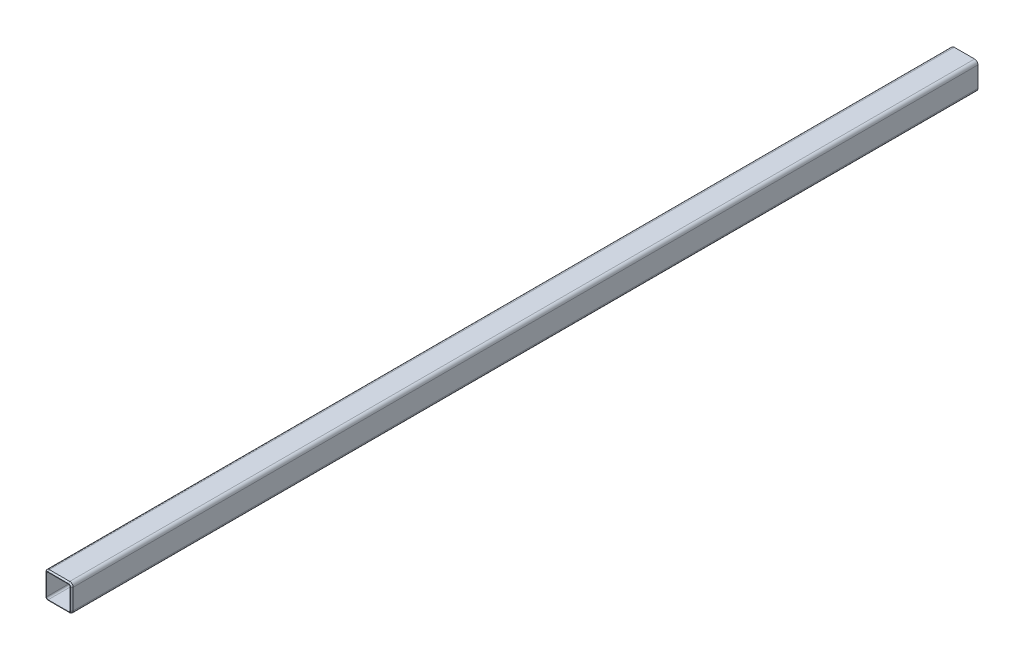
ISO-10303-21;
HEADER;
FILE_DESCRIPTION(('STEP AP214'),'2;1');
FILE_NAME('part.step','',(''),(''),'','','');
FILE_SCHEMA(('AUTOMOTIVE_DESIGN { 1 0 10303 214 1 1 1 1 }'));
ENDSEC;
DATA;
#1=APPLICATION_CONTEXT('core data for automotive mechanical design processes');
#2=APPLICATION_PROTOCOL_DEFINITION('international standard','automotive_design',2000,#1);
#3=PRODUCT_CONTEXT('',#1,'mechanical');
#4=PRODUCT('Part','Part','',(#3));
#5=PRODUCT_RELATED_PRODUCT_CATEGORY('part','',(#4));
#6=PRODUCT_DEFINITION_FORMATION('','',#4);
#7=PRODUCT_DEFINITION_CONTEXT('part definition',#1,'design');
#8=PRODUCT_DEFINITION('design','',#6,#7);
#9=PRODUCT_DEFINITION_SHAPE('','',#8);
#10=(LENGTH_UNIT() NAMED_UNIT(*) SI_UNIT(.MILLI.,.METRE.));
#11=(NAMED_UNIT(*) PLANE_ANGLE_UNIT() SI_UNIT($,.RADIAN.));
#12=(NAMED_UNIT(*) SI_UNIT($,.STERADIAN.) SOLID_ANGLE_UNIT());
#13=UNCERTAINTY_MEASURE_WITH_UNIT(LENGTH_MEASURE(1.E-05),#10,'distance_accuracy_value','');
#14=(GEOMETRIC_REPRESENTATION_CONTEXT(3) GLOBAL_UNCERTAINTY_ASSIGNED_CONTEXT((#13)) GLOBAL_UNIT_ASSIGNED_CONTEXT((#10,
#11,#12)) REPRESENTATION_CONTEXT('',''));
#15=CARTESIAN_POINT('',(0.,0.,0.));
#16=DIRECTION('',(0.,0.,1.));
#17=DIRECTION('',(1.,0.,0.));
#18=AXIS2_PLACEMENT_3D('',#15,#16,#17);
#19=CARTESIAN_POINT('',(-76.2,76.2,-101.6));
#20=DIRECTION('',(0.,0.,1.));
#21=DIRECTION('',(1.,0.,0.));
#22=AXIS2_PLACEMENT_3D('',#19,#20,#21);
#23=CYLINDRICAL_SURFACE('',#22,25.4);
#24=DIRECTION('',(0.,0.,1.));
#25=VECTOR('',#24,1.);
#26=CARTESIAN_POINT('',(-101.6,76.2,-101.6));
#27=LINE('',#26,#25);
#28=CARTESIAN_POINT('',(-101.6,76.2,-101.6));
#29=VERTEX_POINT('',#28);
#30=CARTESIAN_POINT('',(-101.6,76.2,6671.405));
#31=VERTEX_POINT('',#30);
#32=EDGE_CURVE('E318',#29,#31,#27,.T.);
#33=ORIENTED_EDGE('',*,*,#32,.T.);
#34=CARTESIAN_POINT('',(-76.2,76.2,6671.405));
#35=DIRECTION('',(0.,0.,1.));
#36=DIRECTION('',(1.,0.,0.));
#37=AXIS2_PLACEMENT_3D('',#34,#35,#36);
#38=CIRCLE('',#37,25.4);
#39=CARTESIAN_POINT('',(-76.2,101.6,6671.405));
#40=VERTEX_POINT('',#39);
#41=EDGE_CURVE('E379',#31,#40,#38,.F.);
#42=ORIENTED_EDGE('',*,*,#41,.T.);
#43=DIRECTION('',(0.,0.,1.));
#44=VECTOR('',#43,1.);
#45=CARTESIAN_POINT('',(-76.2,101.6,-101.6));
#46=LINE('',#45,#44);
#47=CARTESIAN_POINT('',(-76.2,101.6,-101.6));
#48=VERTEX_POINT('',#47);
#49=EDGE_CURVE('E319',#48,#40,#46,.T.);
#50=ORIENTED_EDGE('',*,*,#49,.F.);
#51=CARTESIAN_POINT('',(-76.2,76.2,-101.6));
#52=DIRECTION('',(0.,0.,1.));
#53=DIRECTION('',(1.,0.,0.));
#54=AXIS2_PLACEMENT_3D('',#51,#52,#53);
#55=CIRCLE('',#54,25.4);
#56=EDGE_CURVE('E269',#48,#29,#55,.T.);
#57=ORIENTED_EDGE('',*,*,#56,.T.);
#58=EDGE_LOOP('',(#33,#42,#50,#57));
#59=FACE_BOUND('',#58,.T.);
#60=ADVANCED_FACE('F47',(#59),#23,.T.);
#61=CARTESIAN_POINT('',(-76.2,101.6,-101.6));
#62=DIRECTION('',(0.,1.,0.));
#63=DIRECTION('',(0.,0.,1.));
#64=AXIS2_PLACEMENT_3D('',#61,#62,#63);
#65=PLANE('',#64);
#66=ORIENTED_EDGE('',*,*,#49,.T.);
#67=DIRECTION('',(1.,0.,0.));
#68=VECTOR('',#67,1.);
#69=CARTESIAN_POINT('',(-76.2,101.6,6671.405));
#70=LINE('',#69,#68);
#71=CARTESIAN_POINT('',(76.2,101.6,6671.405));
#72=VERTEX_POINT('',#71);
#73=EDGE_CURVE('E376',#40,#72,#70,.T.);
#74=ORIENTED_EDGE('',*,*,#73,.T.);
#75=DIRECTION('',(0.,0.,1.));
#76=VECTOR('',#75,1.);
#77=CARTESIAN_POINT('',(76.2,101.6,-101.6));
#78=LINE('',#77,#76);
#79=CARTESIAN_POINT('',(76.2,101.6,-101.6));
#80=VERTEX_POINT('',#79);
#81=EDGE_CURVE('E324',#80,#72,#78,.T.);
#82=ORIENTED_EDGE('',*,*,#81,.F.);
#83=DIRECTION('',(-1.,0.,0.));
#84=VECTOR('',#83,1.);
#85=CARTESIAN_POINT('',(-76.2,101.6,-101.6));
#86=LINE('',#85,#84);
#87=EDGE_CURVE('E314',#80,#48,#86,.T.);
#88=ORIENTED_EDGE('',*,*,#87,.T.);
#89=EDGE_LOOP('',(#66,#74,#82,#88));
#90=FACE_BOUND('',#89,.T.);
#91=ADVANCED_FACE('F448',(#90),#65,.T.);
#92=CARTESIAN_POINT('',(76.2,76.2,-101.6));
#93=DIRECTION('',(0.,0.,1.));
#94=DIRECTION('',(1.,0.,0.));
#95=AXIS2_PLACEMENT_3D('',#92,#93,#94);
#96=CYLINDRICAL_SURFACE('',#95,25.4);
#97=ORIENTED_EDGE('',*,*,#81,.T.);
#98=CARTESIAN_POINT('',(76.2,76.2,6671.405));
#99=DIRECTION('',(0.,0.,1.));
#100=DIRECTION('',(1.,0.,0.));
#101=AXIS2_PLACEMENT_3D('',#98,#99,#100);
#102=CIRCLE('',#101,25.4);
#103=CARTESIAN_POINT('',(101.6,76.2,6671.405));
#104=VERTEX_POINT('',#103);
#105=EDGE_CURVE('E372',#72,#104,#102,.F.);
#106=ORIENTED_EDGE('',*,*,#105,.T.);
#107=DIRECTION('',(0.,0.,1.));
#108=VECTOR('',#107,1.);
#109=CARTESIAN_POINT('',(101.6,76.2,-101.6));
#110=LINE('',#109,#108);
#111=CARTESIAN_POINT('',(101.6,76.2,-101.6));
#112=VERTEX_POINT('',#111);
#113=EDGE_CURVE('E328',#112,#104,#110,.T.);
#114=ORIENTED_EDGE('',*,*,#113,.F.);
#115=CARTESIAN_POINT('',(76.2,76.2,-101.6));
#116=DIRECTION('',(0.,0.,1.));
#117=DIRECTION('',(1.,0.,0.));
#118=AXIS2_PLACEMENT_3D('',#115,#116,#117);
#119=CIRCLE('',#118,25.4);
#120=EDGE_CURVE('E310',#112,#80,#119,.T.);
#121=ORIENTED_EDGE('',*,*,#120,.T.);
#122=EDGE_LOOP('',(#97,#106,#114,#121));
#123=FACE_BOUND('',#122,.T.);
#124=ADVANCED_FACE('F463',(#123),#96,.T.);
#125=CARTESIAN_POINT('',(101.6,-76.2,-101.6));
#126=DIRECTION('',(1.,0.,0.));
#127=DIRECTION('',(0.,0.,-1.));
#128=AXIS2_PLACEMENT_3D('',#125,#126,#127);
#129=PLANE('',#128);
#130=ORIENTED_EDGE('',*,*,#113,.T.);
#131=DIRECTION('',(0.,-1.,0.));
#132=VECTOR('',#131,1.);
#133=CARTESIAN_POINT('',(101.6,-76.2,6671.405));
#134=LINE('',#133,#132);
#135=CARTESIAN_POINT('',(101.6,-76.2,6671.405));
#136=VERTEX_POINT('',#135);
#137=EDGE_CURVE('E11',#104,#136,#134,.T.);
#138=ORIENTED_EDGE('',*,*,#137,.T.);
#139=DIRECTION('',(0.,0.,1.));
#140=VECTOR('',#139,1.);
#141=CARTESIAN_POINT('',(101.6,-76.2,-101.6));
#142=LINE('',#141,#140);
#143=CARTESIAN_POINT('',(101.6,-76.2,-101.6));
#144=VERTEX_POINT('',#143);
#145=EDGE_CURVE('E331',#144,#136,#142,.T.);
#146=ORIENTED_EDGE('',*,*,#145,.F.);
#147=DIRECTION('',(0.,1.,0.));
#148=VECTOR('',#147,1.);
#149=CARTESIAN_POINT('',(101.6,-76.2,-101.6));
#150=LINE('',#149,#148);
#151=EDGE_CURVE('E306',#144,#112,#150,.T.);
#152=ORIENTED_EDGE('',*,*,#151,.T.);
#153=EDGE_LOOP('',(#130,#138,#146,#152));
#154=FACE_BOUND('',#153,.T.);
#155=ADVANCED_FACE('F465',(#154),#129,.T.);
#156=CARTESIAN_POINT('',(76.2,-76.2,-101.6));
#157=DIRECTION('',(0.,0.,1.));
#158=DIRECTION('',(1.,0.,0.));
#159=AXIS2_PLACEMENT_3D('',#156,#157,#158);
#160=CYLINDRICAL_SURFACE('',#159,25.4);
#161=ORIENTED_EDGE('',*,*,#145,.T.);
#162=CARTESIAN_POINT('',(76.2,-76.2,6671.405));
#163=DIRECTION('',(0.,0.,1.));
#164=DIRECTION('',(1.,0.,0.));
#165=AXIS2_PLACEMENT_3D('',#162,#163,#164);
#166=CIRCLE('',#165,25.4);
#167=CARTESIAN_POINT('',(76.2,-101.6,6671.405));
#168=VERTEX_POINT('',#167);
#169=EDGE_CURVE('E58',#136,#168,#166,.F.);
#170=ORIENTED_EDGE('',*,*,#169,.T.);
#171=DIRECTION('',(0.,0.,1.));
#172=VECTOR('',#171,1.);
#173=CARTESIAN_POINT('',(76.2,-101.6,-101.6));
#174=LINE('',#173,#172);
#175=CARTESIAN_POINT('',(76.2,-101.6,-101.6));
#176=VERTEX_POINT('',#175);
#177=EDGE_CURVE('E334',#176,#168,#174,.T.);
#178=ORIENTED_EDGE('',*,*,#177,.F.);
#179=CARTESIAN_POINT('',(76.2,-76.2,-101.6));
#180=DIRECTION('',(0.,0.,1.));
#181=DIRECTION('',(1.,0.,0.));
#182=AXIS2_PLACEMENT_3D('',#179,#180,#181);
#183=CIRCLE('',#182,25.4);
#184=EDGE_CURVE('E302',#176,#144,#183,.T.);
#185=ORIENTED_EDGE('',*,*,#184,.T.);
#186=EDGE_LOOP('',(#161,#170,#178,#185));
#187=FACE_BOUND('',#186,.T.);
#188=ADVANCED_FACE('F468',(#187),#160,.T.);
#189=CARTESIAN_POINT('',(76.2,-101.6,-101.6));
#190=DIRECTION('',(0.,-1.,0.));
#191=DIRECTION('',(0.,0.,-1.));
#192=AXIS2_PLACEMENT_3D('',#189,#190,#191);
#193=PLANE('',#192);
#194=ORIENTED_EDGE('',*,*,#177,.T.);
#195=DIRECTION('',(-1.,0.,0.));
#196=VECTOR('',#195,1.);
#197=CARTESIAN_POINT('',(76.2,-101.6,6671.405));
#198=LINE('',#197,#196);
#199=CARTESIAN_POINT('',(-76.2,-101.6,6671.405));
#200=VERTEX_POINT('',#199);
#201=EDGE_CURVE('E388',#168,#200,#198,.T.);
#202=ORIENTED_EDGE('',*,*,#201,.T.);
#203=DIRECTION('',(0.,0.,1.));
#204=VECTOR('',#203,1.);
#205=CARTESIAN_POINT('',(-76.2,-101.6,-101.6));
#206=LINE('',#205,#204);
#207=CARTESIAN_POINT('',(-76.2,-101.6,-101.6));
#208=VERTEX_POINT('',#207);
#209=EDGE_CURVE('E337',#208,#200,#206,.T.);
#210=ORIENTED_EDGE('',*,*,#209,.F.);
#211=DIRECTION('',(1.,0.,0.));
#212=VECTOR('',#211,1.);
#213=CARTESIAN_POINT('',(76.2,-101.6,-101.6));
#214=LINE('',#213,#212);
#215=EDGE_CURVE('E298',#208,#176,#214,.T.);
#216=ORIENTED_EDGE('',*,*,#215,.T.);
#217=EDGE_LOOP('',(#194,#202,#210,#216));
#218=FACE_BOUND('',#217,.T.);
#219=ADVANCED_FACE('F470',(#218),#193,.T.);
#220=CARTESIAN_POINT('',(-76.2,-76.2,-101.6));
#221=DIRECTION('',(0.,0.,1.));
#222=DIRECTION('',(1.,0.,0.));
#223=AXIS2_PLACEMENT_3D('',#220,#221,#222);
#224=CYLINDRICAL_SURFACE('',#223,25.4);
#225=ORIENTED_EDGE('',*,*,#209,.T.);
#226=CARTESIAN_POINT('',(-76.2,-76.2,6671.405));
#227=DIRECTION('',(0.,0.,1.));
#228=DIRECTION('',(1.,0.,0.));
#229=AXIS2_PLACEMENT_3D('',#226,#227,#228);
#230=CIRCLE('',#229,25.4);
#231=CARTESIAN_POINT('',(-101.6,-76.2,6671.405));
#232=VERTEX_POINT('',#231);
#233=EDGE_CURVE('E385',#200,#232,#230,.F.);
#234=ORIENTED_EDGE('',*,*,#233,.T.);
#235=DIRECTION('',(0.,0.,1.));
#236=VECTOR('',#235,1.);
#237=CARTESIAN_POINT('',(-101.6,-76.2,-101.6));
#238=LINE('',#237,#236);
#239=CARTESIAN_POINT('',(-101.6,-76.2,-101.6));
#240=VERTEX_POINT('',#239);
#241=EDGE_CURVE('E341',#240,#232,#238,.T.);
#242=ORIENTED_EDGE('',*,*,#241,.F.);
#243=CARTESIAN_POINT('',(-76.2,-76.2,-101.6));
#244=DIRECTION('',(0.,0.,1.));
#245=DIRECTION('',(1.,0.,0.));
#246=AXIS2_PLACEMENT_3D('',#243,#244,#245);
#247=CIRCLE('',#246,25.4);
#248=EDGE_CURVE('E294',#240,#208,#247,.T.);
#249=ORIENTED_EDGE('',*,*,#248,.T.);
#250=EDGE_LOOP('',(#225,#234,#242,#249));
#251=FACE_BOUND('',#250,.T.);
#252=ADVANCED_FACE('F433',(#251),#224,.T.);
#253=CARTESIAN_POINT('',(-101.6,76.2,-101.6));
#254=DIRECTION('',(-1.,0.,0.));
#255=DIRECTION('',(0.,-1.,0.));
#256=AXIS2_PLACEMENT_3D('',#253,#254,#255);
#257=PLANE('',#256);
#258=ORIENTED_EDGE('',*,*,#241,.T.);
#259=DIRECTION('',(0.,1.,0.));
#260=VECTOR('',#259,1.);
#261=CARTESIAN_POINT('',(-101.6,76.2,6671.405));
#262=LINE('',#261,#260);
#263=EDGE_CURVE('E382',#232,#31,#262,.T.);
#264=ORIENTED_EDGE('',*,*,#263,.T.);
#265=ORIENTED_EDGE('',*,*,#32,.F.);
#266=DIRECTION('',(0.,-1.,0.));
#267=VECTOR('',#266,1.);
#268=CARTESIAN_POINT('',(-101.6,76.2,-101.6));
#269=LINE('',#268,#267);
#270=EDGE_CURVE('E290',#29,#240,#269,.T.);
#271=ORIENTED_EDGE('',*,*,#270,.T.);
#272=EDGE_LOOP('',(#258,#264,#265,#271));
#273=FACE_BOUND('',#272,.T.);
#274=ADVANCED_FACE('F436',(#273),#257,.T.);
#275=CARTESIAN_POINT('',(-76.2,76.2,-101.6));
#276=DIRECTION('',(0.,0.,1.));
#277=DIRECTION('',(1.,0.,0.));
#278=AXIS2_PLACEMENT_3D('',#275,#276,#277);
#279=PLANE('',#278);
#280=DIRECTION('',(0.,-1.,0.));
#281=VECTOR('',#280,1.);
#282=CARTESIAN_POINT('',(-88.9000000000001,76.2,-101.6));
#283=LINE('',#282,#281);
#284=CARTESIAN_POINT('',(-88.9000000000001,76.2,-101.6));
#285=VERTEX_POINT('',#284);
#286=CARTESIAN_POINT('',(-88.9,-76.2,-101.6));
#287=VERTEX_POINT('',#286);
#288=EDGE_CURVE('E200',#285,#287,#283,.T.);
#289=ORIENTED_EDGE('',*,*,#288,.T.);
#290=CARTESIAN_POINT('',(-76.2,-76.2,-101.6));
#291=DIRECTION('',(0.,0.,1.));
#292=DIRECTION('',(1.,0.,0.));
#293=AXIS2_PLACEMENT_3D('',#290,#291,#292);
#294=CIRCLE('',#293,12.7);
#295=CARTESIAN_POINT('',(-76.2,-88.9,-101.6));
#296=VERTEX_POINT('',#295);
#297=EDGE_CURVE('E239',#287,#296,#294,.T.);
#298=ORIENTED_EDGE('',*,*,#297,.T.);
#299=DIRECTION('',(1.,0.,0.));
#300=VECTOR('',#299,1.);
#301=CARTESIAN_POINT('',(76.2,-88.9,-101.6));
#302=LINE('',#301,#300);
#303=CARTESIAN_POINT('',(76.2,-88.9,-101.6));
#304=VERTEX_POINT('',#303);
#305=EDGE_CURVE('E194',#296,#304,#302,.T.);
#306=ORIENTED_EDGE('',*,*,#305,.T.);
#307=CARTESIAN_POINT('',(76.2,-76.2,-101.6));
#308=DIRECTION('',(0.,0.,1.));
#309=DIRECTION('',(1.,0.,0.));
#310=AXIS2_PLACEMENT_3D('',#307,#308,#309);
#311=CIRCLE('',#310,12.7);
#312=CARTESIAN_POINT('',(88.9,-76.2,-101.6));
#313=VERTEX_POINT('',#312);
#314=EDGE_CURVE('E244',#304,#313,#311,.T.);
#315=ORIENTED_EDGE('',*,*,#314,.T.);
#316=DIRECTION('',(0.,1.,0.));
#317=VECTOR('',#316,1.);
#318=CARTESIAN_POINT('',(88.9,-76.2,-101.6));
#319=LINE('',#318,#317);
#320=CARTESIAN_POINT('',(88.9,76.2,-101.6));
#321=VERTEX_POINT('',#320);
#322=EDGE_CURVE('E248',#313,#321,#319,.T.);
#323=ORIENTED_EDGE('',*,*,#322,.T.);
#324=CARTESIAN_POINT('',(76.2,76.2,-101.6));
#325=DIRECTION('',(0.,0.,1.));
#326=DIRECTION('',(1.,0.,0.));
#327=AXIS2_PLACEMENT_3D('',#324,#325,#326);
#328=CIRCLE('',#327,12.7);
#329=CARTESIAN_POINT('',(76.2,88.9,-101.6));
#330=VERTEX_POINT('',#329);
#331=EDGE_CURVE('E252',#321,#330,#328,.T.);
#332=ORIENTED_EDGE('',*,*,#331,.T.);
#333=DIRECTION('',(-1.,0.,0.));
#334=VECTOR('',#333,1.);
#335=CARTESIAN_POINT('',(-76.2,88.9,-101.6));
#336=LINE('',#335,#334);
#337=CARTESIAN_POINT('',(-76.2,88.9,-101.6));
#338=VERTEX_POINT('',#337);
#339=EDGE_CURVE('E256',#330,#338,#336,.T.);
#340=ORIENTED_EDGE('',*,*,#339,.T.);
#341=CARTESIAN_POINT('',(-76.2,76.2,-101.6));
#342=DIRECTION('',(0.,0.,1.));
#343=DIRECTION('',(1.,0.,0.));
#344=AXIS2_PLACEMENT_3D('',#341,#342,#343);
#345=CIRCLE('',#344,12.7);
#346=EDGE_CURVE('E260',#338,#285,#345,.T.);
#347=ORIENTED_EDGE('',*,*,#346,.T.);
#348=EDGE_LOOP('',(#289,#298,#306,#315,#323,#332,#340,#347));
#349=FACE_BOUND('',#348,.T.);
#350=ORIENTED_EDGE('',*,*,#56,.F.);
#351=ORIENTED_EDGE('',*,*,#87,.F.);
#352=ORIENTED_EDGE('',*,*,#120,.F.);
#353=ORIENTED_EDGE('',*,*,#151,.F.);
#354=ORIENTED_EDGE('',*,*,#184,.F.);
#355=ORIENTED_EDGE('',*,*,#215,.F.);
#356=ORIENTED_EDGE('',*,*,#248,.F.);
#357=ORIENTED_EDGE('',*,*,#270,.F.);
#358=EDGE_LOOP('',(#350,#351,#352,#353,#354,#355,#356,#357));
#359=FACE_BOUND('',#358,.T.);
#360=ADVANCED_FACE('F440',(#349,#359),#279,.F.);
#361=CARTESIAN_POINT('',(-76.2,-76.2,-101.6));
#362=DIRECTION('',(0.,0.,1.));
#363=DIRECTION('',(1.,0.,0.));
#364=AXIS2_PLACEMENT_3D('',#361,#362,#363);
#365=CYLINDRICAL_SURFACE('',#364,12.7);
#366=DIRECTION('',(0.,0.,1.));
#367=VECTOR('',#366,1.);
#368=CARTESIAN_POINT('',(-88.9,-76.2,-101.6));
#369=LINE('',#368,#367);
#370=CARTESIAN_POINT('',(-88.9,-76.2,6680.93));
#371=VERTEX_POINT('',#370);
#372=EDGE_CURVE('E205',#287,#371,#369,.T.);
#373=ORIENTED_EDGE('',*,*,#372,.T.);
#374=CARTESIAN_POINT('',(-76.2,-76.2,6680.93));
#375=DIRECTION('',(0.,0.,1.));
#376=DIRECTION('',(1.,0.,0.));
#377=AXIS2_PLACEMENT_3D('',#374,#375,#376);
#378=CIRCLE('',#377,12.7);
#379=CARTESIAN_POINT('',(-76.2,-88.9,6680.93));
#380=VERTEX_POINT('',#379);
#381=EDGE_CURVE('E203',#371,#380,#378,.T.);
#382=ORIENTED_EDGE('',*,*,#381,.T.);
#383=DIRECTION('',(0.,0.,1.));
#384=VECTOR('',#383,1.);
#385=CARTESIAN_POINT('',(-76.2,-88.9,-101.6));
#386=LINE('',#385,#384);
#387=EDGE_CURVE('E186',#296,#380,#386,.T.);
#388=ORIENTED_EDGE('',*,*,#387,.F.);
#389=ORIENTED_EDGE('',*,*,#297,.F.);
#390=EDGE_LOOP('',(#373,#382,#388,#389));
#391=FACE_BOUND('',#390,.T.);
#392=ADVANCED_FACE('F204',(#391),#365,.F.);
#393=CARTESIAN_POINT('',(-88.9000000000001,76.2,-101.6));
#394=DIRECTION('',(-1.,0.,0.));
#395=DIRECTION('',(0.,-1.,0.));
#396=AXIS2_PLACEMENT_3D('',#393,#394,#395);
#397=PLANE('',#396);
#398=DIRECTION('',(0.,0.,1.));
#399=VECTOR('',#398,1.);
#400=CARTESIAN_POINT('',(-88.9000000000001,76.2,-101.6));
#401=LINE('',#400,#399);
#402=CARTESIAN_POINT('',(-88.9000000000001,76.2,6680.93));
#403=VERTEX_POINT('',#402);
#404=EDGE_CURVE('E270',#285,#403,#401,.T.);
#405=ORIENTED_EDGE('',*,*,#404,.T.);
#406=DIRECTION('',(0.,-1.,0.));
#407=VECTOR('',#406,1.);
#408=CARTESIAN_POINT('',(-88.9000000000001,76.2,6680.93));
#409=LINE('',#408,#407);
#410=EDGE_CURVE('E236',#403,#371,#409,.T.);
#411=ORIENTED_EDGE('',*,*,#410,.T.);
#412=ORIENTED_EDGE('',*,*,#372,.F.);
#413=ORIENTED_EDGE('',*,*,#288,.F.);
#414=EDGE_LOOP('',(#405,#411,#412,#413));
#415=FACE_BOUND('',#414,.T.);
#416=ADVANCED_FACE('F540',(#415),#397,.F.);
#417=CARTESIAN_POINT('',(-76.2,76.2,-101.6));
#418=DIRECTION('',(0.,0.,1.));
#419=DIRECTION('',(1.,0.,0.));
#420=AXIS2_PLACEMENT_3D('',#417,#418,#419);
#421=CYLINDRICAL_SURFACE('',#420,12.7);
#422=DIRECTION('',(0.,0.,1.));
#423=VECTOR('',#422,1.);
#424=CARTESIAN_POINT('',(-76.2,88.9,-101.6));
#425=LINE('',#424,#423);
#426=CARTESIAN_POINT('',(-76.2,88.9,6680.93));
#427=VERTEX_POINT('',#426);
#428=EDGE_CURVE('E273',#338,#427,#425,.T.);
#429=ORIENTED_EDGE('',*,*,#428,.T.);
#430=CARTESIAN_POINT('',(-76.2,76.2,6680.93));
#431=DIRECTION('',(0.,0.,1.));
#432=DIRECTION('',(1.,0.,0.));
#433=AXIS2_PLACEMENT_3D('',#430,#431,#432);
#434=CIRCLE('',#433,12.7);
#435=EDGE_CURVE('E232',#427,#403,#434,.T.);
#436=ORIENTED_EDGE('',*,*,#435,.T.);
#437=ORIENTED_EDGE('',*,*,#404,.F.);
#438=ORIENTED_EDGE('',*,*,#346,.F.);
#439=EDGE_LOOP('',(#429,#436,#437,#438));
#440=FACE_BOUND('',#439,.T.);
#441=ADVANCED_FACE('F543',(#440),#421,.F.);
#442=CARTESIAN_POINT('',(-76.2,88.9,-101.6));
#443=DIRECTION('',(0.,1.,0.));
#444=DIRECTION('',(0.,0.,1.));
#445=AXIS2_PLACEMENT_3D('',#442,#443,#444);
#446=PLANE('',#445);
#447=DIRECTION('',(0.,0.,1.));
#448=VECTOR('',#447,1.);
#449=CARTESIAN_POINT('',(76.2,88.9,-101.6));
#450=LINE('',#449,#448);
#451=CARTESIAN_POINT('',(76.2,88.9,6680.93));
#452=VERTEX_POINT('',#451);
#453=EDGE_CURVE('E276',#330,#452,#450,.T.);
#454=ORIENTED_EDGE('',*,*,#453,.T.);
#455=DIRECTION('',(-1.,0.,0.));
#456=VECTOR('',#455,1.);
#457=CARTESIAN_POINT('',(-76.2,88.9,6680.93));
#458=LINE('',#457,#456);
#459=EDGE_CURVE('E228',#452,#427,#458,.T.);
#460=ORIENTED_EDGE('',*,*,#459,.T.);
#461=ORIENTED_EDGE('',*,*,#428,.F.);
#462=ORIENTED_EDGE('',*,*,#339,.F.);
#463=EDGE_LOOP('',(#454,#460,#461,#462));
#464=FACE_BOUND('',#463,.T.);
#465=ADVANCED_FACE('F547',(#464),#446,.F.);
#466=CARTESIAN_POINT('',(76.2,76.2,-101.6));
#467=DIRECTION('',(0.,0.,1.));
#468=DIRECTION('',(1.,0.,0.));
#469=AXIS2_PLACEMENT_3D('',#466,#467,#468);
#470=CYLINDRICAL_SURFACE('',#469,12.7);
#471=DIRECTION('',(0.,0.,1.));
#472=VECTOR('',#471,1.);
#473=CARTESIAN_POINT('',(88.9,76.2,-101.6));
#474=LINE('',#473,#472);
#475=CARTESIAN_POINT('',(88.9,76.2,6680.93));
#476=VERTEX_POINT('',#475);
#477=EDGE_CURVE('E279',#321,#476,#474,.T.);
#478=ORIENTED_EDGE('',*,*,#477,.T.);
#479=CARTESIAN_POINT('',(76.2,76.2,6680.93));
#480=DIRECTION('',(0.,0.,1.));
#481=DIRECTION('',(1.,0.,0.));
#482=AXIS2_PLACEMENT_3D('',#479,#480,#481);
#483=CIRCLE('',#482,12.7);
#484=EDGE_CURVE('E224',#476,#452,#483,.T.);
#485=ORIENTED_EDGE('',*,*,#484,.T.);
#486=ORIENTED_EDGE('',*,*,#453,.F.);
#487=ORIENTED_EDGE('',*,*,#331,.F.);
#488=EDGE_LOOP('',(#478,#485,#486,#487));
#489=FACE_BOUND('',#488,.T.);
#490=ADVANCED_FACE('F551',(#489),#470,.F.);
#491=CARTESIAN_POINT('',(88.9,-76.2,-101.6));
#492=DIRECTION('',(1.,0.,0.));
#493=DIRECTION('',(0.,0.,-1.));
#494=AXIS2_PLACEMENT_3D('',#491,#492,#493);
#495=PLANE('',#494);
#496=DIRECTION('',(0.,0.,1.));
#497=VECTOR('',#496,1.);
#498=CARTESIAN_POINT('',(88.9,-76.2,-101.6));
#499=LINE('',#498,#497);
#500=CARTESIAN_POINT('',(88.9,-76.2,6680.93));
#501=VERTEX_POINT('',#500);
#502=EDGE_CURVE('E282',#313,#501,#499,.T.);
#503=ORIENTED_EDGE('',*,*,#502,.T.);
#504=DIRECTION('',(0.,1.,0.));
#505=VECTOR('',#504,1.);
#506=CARTESIAN_POINT('',(88.9,-76.2,6680.93));
#507=LINE('',#506,#505);
#508=EDGE_CURVE('E218',#501,#476,#507,.T.);
#509=ORIENTED_EDGE('',*,*,#508,.T.);
#510=ORIENTED_EDGE('',*,*,#477,.F.);
#511=ORIENTED_EDGE('',*,*,#322,.F.);
#512=EDGE_LOOP('',(#503,#509,#510,#511));
#513=FACE_BOUND('',#512,.T.);
#514=ADVANCED_FACE('F555',(#513),#495,.F.);
#515=CARTESIAN_POINT('',(76.2,-76.2,-101.6));
#516=DIRECTION('',(0.,0.,1.));
#517=DIRECTION('',(1.,0.,0.));
#518=AXIS2_PLACEMENT_3D('',#515,#516,#517);
#519=CYLINDRICAL_SURFACE('',#518,12.7);
#520=DIRECTION('',(0.,0.,1.));
#521=VECTOR('',#520,1.);
#522=CARTESIAN_POINT('',(76.2,-88.9,-101.6));
#523=LINE('',#522,#521);
#524=CARTESIAN_POINT('',(76.2,-88.9,6680.93));
#525=VERTEX_POINT('',#524);
#526=EDGE_CURVE('E199',#304,#525,#523,.T.);
#527=ORIENTED_EDGE('',*,*,#526,.T.);
#528=CARTESIAN_POINT('',(76.2,-76.2,6680.93));
#529=DIRECTION('',(0.,0.,1.));
#530=DIRECTION('',(1.,0.,0.));
#531=AXIS2_PLACEMENT_3D('',#528,#529,#530);
#532=CIRCLE('',#531,12.7);
#533=EDGE_CURVE('E214',#525,#501,#532,.T.);
#534=ORIENTED_EDGE('',*,*,#533,.T.);
#535=ORIENTED_EDGE('',*,*,#502,.F.);
#536=ORIENTED_EDGE('',*,*,#314,.F.);
#537=EDGE_LOOP('',(#527,#534,#535,#536));
#538=FACE_BOUND('',#537,.T.);
#539=ADVANCED_FACE('F537',(#538),#519,.F.);
#540=CARTESIAN_POINT('',(76.2,-88.9,-101.6));
#541=DIRECTION('',(0.,-1.,0.));
#542=DIRECTION('',(0.,0.,-1.));
#543=AXIS2_PLACEMENT_3D('',#540,#541,#542);
#544=PLANE('',#543);
#545=ORIENTED_EDGE('',*,*,#387,.T.);
#546=DIRECTION('',(1.,0.,0.));
#547=VECTOR('',#546,1.);
#548=CARTESIAN_POINT('',(76.2,-88.9,6680.93));
#549=LINE('',#548,#547);
#550=EDGE_CURVE('E191',#380,#525,#549,.T.);
#551=ORIENTED_EDGE('',*,*,#550,.T.);
#552=ORIENTED_EDGE('',*,*,#526,.F.);
#553=ORIENTED_EDGE('',*,*,#305,.F.);
#554=EDGE_LOOP('',(#545,#551,#552,#553));
#555=FACE_BOUND('',#554,.T.);
#556=ADVANCED_FACE('F188',(#555),#544,.F.);
#557=CARTESIAN_POINT('',(-76.2,76.2,6680.93));
#558=DIRECTION('',(0.,0.,1.));
#559=DIRECTION('',(1.,0.,0.));
#560=AXIS2_PLACEMENT_3D('',#557,#558,#559);
#561=PLANE('',#560);
#562=DIRECTION('',(0.,1.,0.));
#563=VECTOR('',#562,1.);
#564=CARTESIAN_POINT('',(92.0749999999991,76.2,6680.93));
#565=LINE('',#564,#563);
#566=CARTESIAN_POINT('',(92.0749999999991,-76.2,6680.93));
#567=VERTEX_POINT('',#566);
#568=CARTESIAN_POINT('',(92.0749999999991,76.2,6680.93));
#569=VERTEX_POINT('',#568);
#570=EDGE_CURVE('E323',#567,#569,#565,.T.);
#571=ORIENTED_EDGE('',*,*,#570,.T.);
#572=CARTESIAN_POINT('',(76.2,76.2,6680.93));
#573=DIRECTION('',(0.,0.,1.));
#574=DIRECTION('',(1.,0.,0.));
#575=AXIS2_PLACEMENT_3D('',#572,#573,#574);
#576=CIRCLE('',#575,15.8749999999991);
#577=CARTESIAN_POINT('',(76.2,92.0749999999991,6680.93));
#578=VERTEX_POINT('',#577);
#579=EDGE_CURVE('E368',#569,#578,#576,.T.);
#580=ORIENTED_EDGE('',*,*,#579,.T.);
#581=DIRECTION('',(-1.,0.,0.));
#582=VECTOR('',#581,1.);
#583=CARTESIAN_POINT('',(-76.2,92.0749999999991,6680.93));
#584=LINE('',#583,#582);
#585=CARTESIAN_POINT('',(-76.2,92.0749999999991,6680.93));
#586=VERTEX_POINT('',#585);
#587=EDGE_CURVE('E365',#578,#586,#584,.T.);
#588=ORIENTED_EDGE('',*,*,#587,.T.);
#589=CARTESIAN_POINT('',(-76.2,76.2,6680.93));
#590=DIRECTION('',(0.,0.,1.));
#591=DIRECTION('',(1.,0.,0.));
#592=AXIS2_PLACEMENT_3D('',#589,#590,#591);
#593=CIRCLE('',#592,15.8749999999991);
#594=CARTESIAN_POINT('',(-92.0749999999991,76.2,6680.93));
#595=VERTEX_POINT('',#594);
#596=EDGE_CURVE('E362',#586,#595,#593,.T.);
#597=ORIENTED_EDGE('',*,*,#596,.T.);
#598=DIRECTION('',(0.,-1.,0.));
#599=VECTOR('',#598,1.);
#600=CARTESIAN_POINT('',(-92.0749999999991,76.2,6680.93));
#601=LINE('',#600,#599);
#602=CARTESIAN_POINT('',(-92.0749999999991,-76.2,6680.93));
#603=VERTEX_POINT('',#602);
#604=EDGE_CURVE('E359',#595,#603,#601,.T.);
#605=ORIENTED_EDGE('',*,*,#604,.T.);
#606=CARTESIAN_POINT('',(-76.2,-76.2,6680.93));
#607=DIRECTION('',(0.,0.,1.));
#608=DIRECTION('',(1.,0.,0.));
#609=AXIS2_PLACEMENT_3D('',#606,#607,#608);
#610=CIRCLE('',#609,15.8749999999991);
#611=CARTESIAN_POINT('',(-76.2,-92.0749999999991,6680.93));
#612=VERTEX_POINT('',#611);
#613=EDGE_CURVE('E356',#603,#612,#610,.T.);
#614=ORIENTED_EDGE('',*,*,#613,.T.);
#615=DIRECTION('',(1.,0.,0.));
#616=VECTOR('',#615,1.);
#617=CARTESIAN_POINT('',(-76.2,-92.0749999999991,6680.93));
#618=LINE('',#617,#616);
#619=CARTESIAN_POINT('',(76.2,-92.0749999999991,6680.93));
#620=VERTEX_POINT('',#619);
#621=EDGE_CURVE('E353',#612,#620,#618,.T.);
#622=ORIENTED_EDGE('',*,*,#621,.T.);
#623=CARTESIAN_POINT('',(76.2,-76.2,6680.93));
#624=DIRECTION('',(0.,0.,1.));
#625=DIRECTION('',(1.,0.,0.));
#626=AXIS2_PLACEMENT_3D('',#623,#624,#625);
#627=CIRCLE('',#626,15.8749999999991);
#628=EDGE_CURVE('E350',#620,#567,#627,.T.);
#629=ORIENTED_EDGE('',*,*,#628,.T.);
#630=EDGE_LOOP('',(#571,#580,#588,#597,#605,#614,#622,#629));
#631=FACE_BOUND('',#630,.T.);
#632=ORIENTED_EDGE('',*,*,#550,.F.);
#633=ORIENTED_EDGE('',*,*,#381,.F.);
#634=ORIENTED_EDGE('',*,*,#410,.F.);
#635=ORIENTED_EDGE('',*,*,#435,.F.);
#636=ORIENTED_EDGE('',*,*,#459,.F.);
#637=ORIENTED_EDGE('',*,*,#484,.F.);
#638=ORIENTED_EDGE('',*,*,#508,.F.);
#639=ORIENTED_EDGE('',*,*,#533,.F.);
#640=EDGE_LOOP('',(#632,#633,#634,#635,#636,#637,#638,#639));
#641=FACE_BOUND('',#640,.T.);
#642=ADVANCED_FACE('F211',(#631,#641),#561,.T.);
#643=CARTESIAN_POINT('',(-76.2,-76.2,6680.93));
#644=DIRECTION('',(0.,0.,-1.));
#645=DIRECTION('',(-1.,0.,0.));
#646=AXIS2_PLACEMENT_3D('',#643,#644,#645);
#647=CONICAL_SURFACE('',#646,15.8749999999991,0.785398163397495);
#648=DIRECTION('',(0.70710678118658,0.,0.707106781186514));
#649=VECTOR('',#648,1.);
#650=CARTESIAN_POINT('',(-101.6,-76.2,6671.405));
#651=LINE('',#650,#649);
#652=EDGE_CURVE('E414',#232,#603,#651,.T.);
#653=ORIENTED_EDGE('',*,*,#652,.F.);
#654=ORIENTED_EDGE('',*,*,#233,.F.);
#655=DIRECTION('',(0.,-0.70710678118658,-0.707106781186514));
#656=VECTOR('',#655,1.);
#657=CARTESIAN_POINT('',(-76.2,-92.0749999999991,6680.93));
#658=LINE('',#657,#656);
#659=EDGE_CURVE('E52',#612,#200,#658,.T.);
#660=ORIENTED_EDGE('',*,*,#659,.F.);
#661=ORIENTED_EDGE('',*,*,#613,.F.);
#662=EDGE_LOOP('',(#653,#654,#660,#661));
#663=FACE_BOUND('',#662,.T.);
#664=ADVANCED_FACE('F50',(#663),#647,.T.);
#665=CARTESIAN_POINT('',(-76.2,-92.0749999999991,6680.93));
#666=DIRECTION('',(0.,0.707106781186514,-0.70710678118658));
#667=DIRECTION('',(1.,0.,0.));
#668=AXIS2_PLACEMENT_3D('',#665,#666,#667);
#669=PLANE('',#668);
#670=ORIENTED_EDGE('',*,*,#659,.T.);
#671=ORIENTED_EDGE('',*,*,#201,.F.);
#672=DIRECTION('',(0.,-0.70710678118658,-0.707106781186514));
#673=VECTOR('',#672,1.);
#674=CARTESIAN_POINT('',(76.2,-92.0749999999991,6680.93));
#675=LINE('',#674,#673);
#676=EDGE_CURVE('E411',#620,#168,#675,.T.);
#677=ORIENTED_EDGE('',*,*,#676,.F.);
#678=ORIENTED_EDGE('',*,*,#621,.F.);
#679=EDGE_LOOP('',(#670,#671,#677,#678));
#680=FACE_BOUND('',#679,.T.);
#681=ADVANCED_FACE('F427',(#680),#669,.F.);
#682=CARTESIAN_POINT('',(-92.0749999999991,76.2,6680.93));
#683=DIRECTION('',(0.707106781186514,0.,-0.70710678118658));
#684=DIRECTION('',(0.,-1.,0.));
#685=AXIS2_PLACEMENT_3D('',#682,#683,#684);
#686=PLANE('',#685);
#687=ORIENTED_EDGE('',*,*,#652,.T.);
#688=ORIENTED_EDGE('',*,*,#604,.F.);
#689=DIRECTION('',(0.70710678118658,0.,0.707106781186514));
#690=VECTOR('',#689,1.);
#691=CARTESIAN_POINT('',(-101.6,76.2,6671.405));
#692=LINE('',#691,#690);
#693=EDGE_CURVE('E407',#31,#595,#692,.T.);
#694=ORIENTED_EDGE('',*,*,#693,.F.);
#695=ORIENTED_EDGE('',*,*,#263,.F.);
#696=EDGE_LOOP('',(#687,#688,#694,#695));
#697=FACE_BOUND('',#696,.T.);
#698=ADVANCED_FACE('F517',(#697),#686,.F.);
#699=CARTESIAN_POINT('',(76.2,-76.2,6680.93));
#700=DIRECTION('',(0.,0.,-1.));
#701=DIRECTION('',(-1.,0.,0.));
#702=AXIS2_PLACEMENT_3D('',#699,#700,#701);
#703=CONICAL_SURFACE('',#702,15.8749999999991,0.785398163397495);
#704=ORIENTED_EDGE('',*,*,#676,.T.);
#705=ORIENTED_EDGE('',*,*,#169,.F.);
#706=DIRECTION('',(0.70710678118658,0.,-0.707106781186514));
#707=VECTOR('',#706,1.);
#708=CARTESIAN_POINT('',(92.0749999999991,-76.2,6680.93));
#709=LINE('',#708,#707);
#710=EDGE_CURVE('E403',#567,#136,#709,.T.);
#711=ORIENTED_EDGE('',*,*,#710,.F.);
#712=ORIENTED_EDGE('',*,*,#628,.F.);
#713=EDGE_LOOP('',(#704,#705,#711,#712));
#714=FACE_BOUND('',#713,.T.);
#715=ADVANCED_FACE('F511',(#714),#703,.T.);
#716=CARTESIAN_POINT('',(-76.2,76.2,6680.93));
#717=DIRECTION('',(0.,0.,-1.));
#718=DIRECTION('',(-1.,0.,0.));
#719=AXIS2_PLACEMENT_3D('',#716,#717,#718);
#720=CONICAL_SURFACE('',#719,15.8749999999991,0.785398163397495);
#721=ORIENTED_EDGE('',*,*,#693,.T.);
#722=ORIENTED_EDGE('',*,*,#596,.F.);
#723=DIRECTION('',(0.,-0.70710678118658,0.707106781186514));
#724=VECTOR('',#723,1.);
#725=CARTESIAN_POINT('',(-76.2,101.6,6671.405));
#726=LINE('',#725,#724);
#727=EDGE_CURVE('E399',#40,#586,#726,.T.);
#728=ORIENTED_EDGE('',*,*,#727,.F.);
#729=ORIENTED_EDGE('',*,*,#41,.F.);
#730=EDGE_LOOP('',(#721,#722,#728,#729));
#731=FACE_BOUND('',#730,.T.);
#732=ADVANCED_FACE('F452',(#731),#720,.T.);
#733=CARTESIAN_POINT('',(92.0749999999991,76.2,6680.93));
#734=DIRECTION('',(-0.707106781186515,0.,-0.70710678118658));
#735=DIRECTION('',(0.,1.,0.));
#736=AXIS2_PLACEMENT_3D('',#733,#734,#735);
#737=PLANE('',#736);
#738=ORIENTED_EDGE('',*,*,#710,.T.);
#739=ORIENTED_EDGE('',*,*,#137,.F.);
#740=DIRECTION('',(0.70710678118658,0.,-0.707106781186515));
#741=VECTOR('',#740,1.);
#742=CARTESIAN_POINT('',(92.0749999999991,76.2,6680.93));
#743=LINE('',#742,#741);
#744=EDGE_CURVE('E396',#569,#104,#743,.T.);
#745=ORIENTED_EDGE('',*,*,#744,.F.);
#746=ORIENTED_EDGE('',*,*,#570,.F.);
#747=EDGE_LOOP('',(#738,#739,#745,#746));
#748=FACE_BOUND('',#747,.T.);
#749=ADVANCED_FACE('F499',(#748),#737,.F.);
#750=CARTESIAN_POINT('',(-76.2,92.0749999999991,6680.93));
#751=DIRECTION('',(0.,-0.707106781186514,-0.70710678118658));
#752=DIRECTION('',(-1.,0.,0.));
#753=AXIS2_PLACEMENT_3D('',#750,#751,#752);
#754=PLANE('',#753);
#755=ORIENTED_EDGE('',*,*,#727,.T.);
#756=ORIENTED_EDGE('',*,*,#587,.F.);
#757=DIRECTION('',(0.,-0.70710678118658,0.707106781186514));
#758=VECTOR('',#757,1.);
#759=CARTESIAN_POINT('',(76.2,101.6,6671.405));
#760=LINE('',#759,#758);
#761=EDGE_CURVE('E393',#72,#578,#760,.T.);
#762=ORIENTED_EDGE('',*,*,#761,.F.);
#763=ORIENTED_EDGE('',*,*,#73,.F.);
#764=EDGE_LOOP('',(#755,#756,#762,#763));
#765=FACE_BOUND('',#764,.T.);
#766=ADVANCED_FACE('F456',(#765),#754,.F.);
#767=CARTESIAN_POINT('',(76.2,76.2,6680.93));
#768=DIRECTION('',(0.,0.,-1.));
#769=DIRECTION('',(-1.,0.,0.));
#770=AXIS2_PLACEMENT_3D('',#767,#768,#769);
#771=CONICAL_SURFACE('',#770,15.8749999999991,0.785398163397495);
#772=ORIENTED_EDGE('',*,*,#744,.T.);
#773=ORIENTED_EDGE('',*,*,#105,.F.);
#774=ORIENTED_EDGE('',*,*,#761,.T.);
#775=ORIENTED_EDGE('',*,*,#579,.F.);
#776=EDGE_LOOP('',(#772,#773,#774,#775));
#777=FACE_BOUND('',#776,.T.);
#778=ADVANCED_FACE('F460',(#777),#771,.T.);
#779=CLOSED_SHELL('',(#60,#91,#124,#155,#188,#219,#252,#274,#360,#392,#416,#441,#465,#490,#514,
#539,#556,#642,#664,#681,#698,#715,#732,#749,#766,#778));
#780=MANIFOLD_SOLID_BREP('B2',#779);
#781=ADVANCED_BREP_SHAPE_REPRESENTATION('',(#18,#780),#14);
#782=SHAPE_DEFINITION_REPRESENTATION(#9,#781);
ENDSEC;
END-ISO-10303-21;
